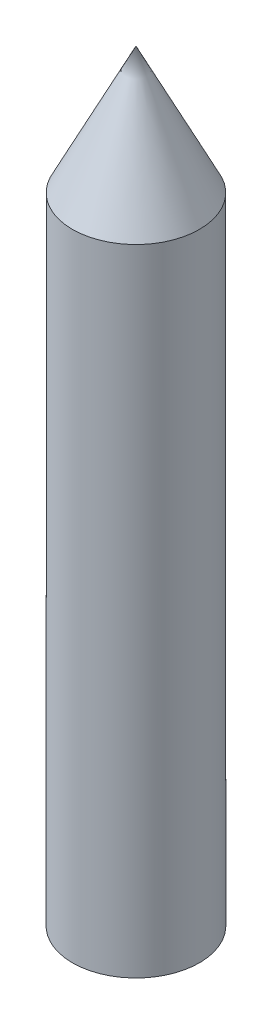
ISO-10303-21;
HEADER;
FILE_DESCRIPTION(('STEP AP214'),'2;1');
FILE_NAME('part.step','',(''),(''),'','','');
FILE_SCHEMA(('AUTOMOTIVE_DESIGN { 1 0 10303 214 1 1 1 1 }'));
ENDSEC;
DATA;
#1=APPLICATION_CONTEXT('core data for automotive mechanical design processes');
#2=APPLICATION_PROTOCOL_DEFINITION('international standard','automotive_design',2000,#1);
#3=PRODUCT_CONTEXT('',#1,'mechanical');
#4=PRODUCT('Part','Part','',(#3));
#5=PRODUCT_RELATED_PRODUCT_CATEGORY('part','',(#4));
#6=PRODUCT_DEFINITION_FORMATION('','',#4);
#7=PRODUCT_DEFINITION_CONTEXT('part definition',#1,'design');
#8=PRODUCT_DEFINITION('design','',#6,#7);
#9=PRODUCT_DEFINITION_SHAPE('','',#8);
#10=(LENGTH_UNIT() NAMED_UNIT(*) SI_UNIT(.MILLI.,.METRE.));
#11=(NAMED_UNIT(*) PLANE_ANGLE_UNIT() SI_UNIT($,.RADIAN.));
#12=(NAMED_UNIT(*) SI_UNIT($,.STERADIAN.) SOLID_ANGLE_UNIT());
#13=UNCERTAINTY_MEASURE_WITH_UNIT(LENGTH_MEASURE(1.E-05),#10,'distance_accuracy_value','');
#14=(GEOMETRIC_REPRESENTATION_CONTEXT(3) GLOBAL_UNCERTAINTY_ASSIGNED_CONTEXT((#13)) GLOBAL_UNIT_ASSIGNED_CONTEXT((#10,
#11,#12)) REPRESENTATION_CONTEXT('',''));
#15=CARTESIAN_POINT('',(0.,0.,0.));
#16=DIRECTION('',(0.,0.,1.));
#17=DIRECTION('',(1.,0.,0.));
#18=AXIS2_PLACEMENT_3D('',#15,#16,#17);
#19=CARTESIAN_POINT('',(0.,50.,0.));
#20=DIRECTION('',(0.,-1.,0.));
#21=DIRECTION('',(0.,0.,-1.));
#22=AXIS2_PLACEMENT_3D('',#19,#20,#21);
#23=CYLINDRICAL_SURFACE('',#22,5.);
#24=CARTESIAN_POINT('',(0.,50.,0.));
#25=DIRECTION('',(0.,1.,0.));
#26=DIRECTION('',(0.,0.,1.));
#27=AXIS2_PLACEMENT_3D('',#24,#25,#26);
#28=CIRCLE('',#27,5.);
#29=CARTESIAN_POINT('',(0.,50.,5.));
#30=VERTEX_POINT('',#29);
#31=EDGE_CURVE('E11',#30,#30,#28,.T.);
#32=ORIENTED_EDGE('',*,*,#31,.F.);
#33=EDGE_LOOP('',(#32));
#34=FACE_BOUND('',#33,.T.);
#35=CARTESIAN_POINT('',(0.,0.,0.));
#36=DIRECTION('',(0.,1.,0.));
#37=DIRECTION('',(0.,0.,1.));
#38=AXIS2_PLACEMENT_3D('',#35,#36,#37);
#39=CIRCLE('',#38,5.);
#40=CARTESIAN_POINT('',(0.,0.,5.));
#41=VERTEX_POINT('',#40);
#42=EDGE_CURVE('E42',#41,#41,#39,.T.);
#43=ORIENTED_EDGE('',*,*,#42,.T.);
#44=EDGE_LOOP('',(#43));
#45=FACE_BOUND('',#44,.T.);
#46=ADVANCED_FACE('F39',(#34,#45),#23,.T.);
#47=CARTESIAN_POINT('',(0.,0.,0.));
#48=DIRECTION('',(0.,1.,0.));
#49=DIRECTION('',(0.,0.,1.));
#50=AXIS2_PLACEMENT_3D('',#47,#48,#49);
#51=PLANE('',#50);
#52=ORIENTED_EDGE('',*,*,#42,.F.);
#53=EDGE_LOOP('',(#52));
#54=FACE_BOUND('',#53,.T.);
#55=ADVANCED_FACE('F51',(#54),#51,.F.);
#56=CARTESIAN_POINT('',(0.,50.,0.));
#57=DIRECTION('',(0.,-1.,0.));
#58=DIRECTION('',(0.,0.,-1.));
#59=AXIS2_PLACEMENT_3D('',#56,#57,#58);
#60=CONICAL_SURFACE('',#59,5.,0.463647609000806);
#61=CARTESIAN_POINT('',(0.,60.,0.));
#62=VERTEX_POINT('',#61);
#63=VERTEX_LOOP('',#62);
#64=FACE_BOUND('',#63,.T.);
#65=ORIENTED_EDGE('',*,*,#31,.T.);
#66=EDGE_LOOP('',(#65));
#67=FACE_BOUND('',#66,.T.);
#68=ADVANCED_FACE('F48',(#64,#67),#60,.T.);
#69=CLOSED_SHELL('',(#46,#55,#68));
#70=MANIFOLD_SOLID_BREP('B2',#69);
#71=ADVANCED_BREP_SHAPE_REPRESENTATION('',(#18,#70),#14);
#72=SHAPE_DEFINITION_REPRESENTATION(#9,#71);
ENDSEC;
END-ISO-10303-21;
